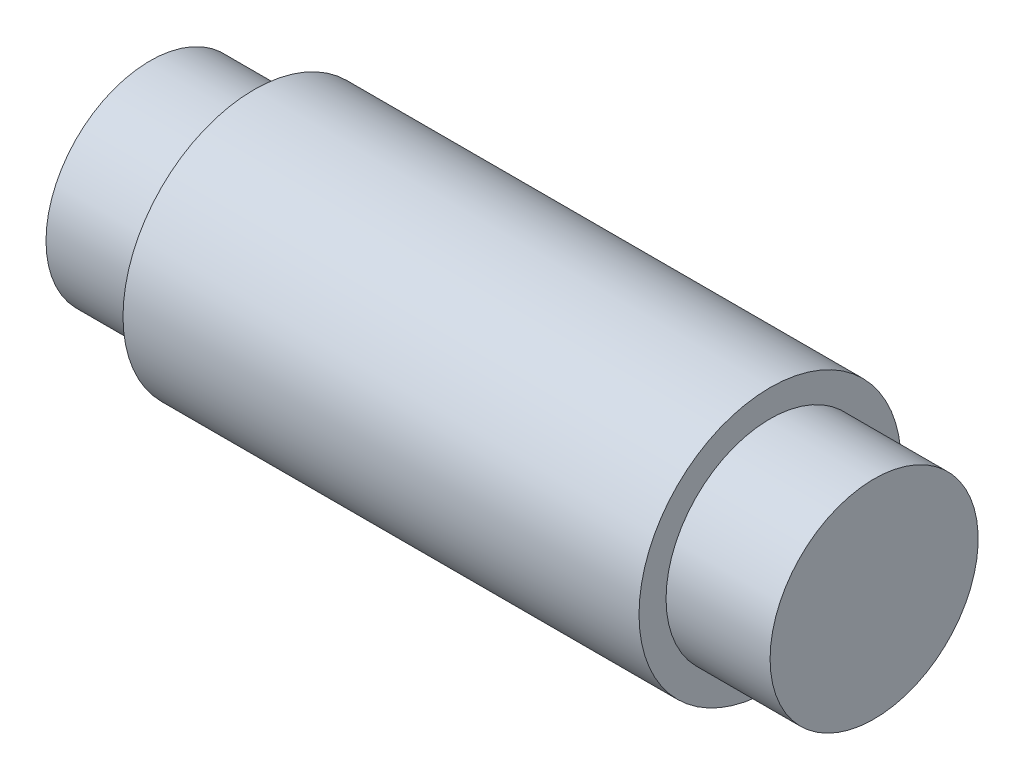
from build123d import *


with BuildPart() as part:
    # Sketch1 → Revolve1 (revolve)
    with BuildSketch(Plane.XY, mode=Mode.PRIVATE) as revolve1_sk:
        Polygon((-11.049, 0), (11.049, 0), (11.049, 3.175), (7.874, 3.175), (7.874, 4), (-7.874, 4), (-7.874, 3.175), (-11.049, 3.175), align=None)
    revolve(revolve1_sk.sketch.rotate(Axis((11.049, 0, 0), (1, 0, 0)), 90), axis=Axis((11.049, 0, 0), (1, 0, 0)))


solid = part.part
